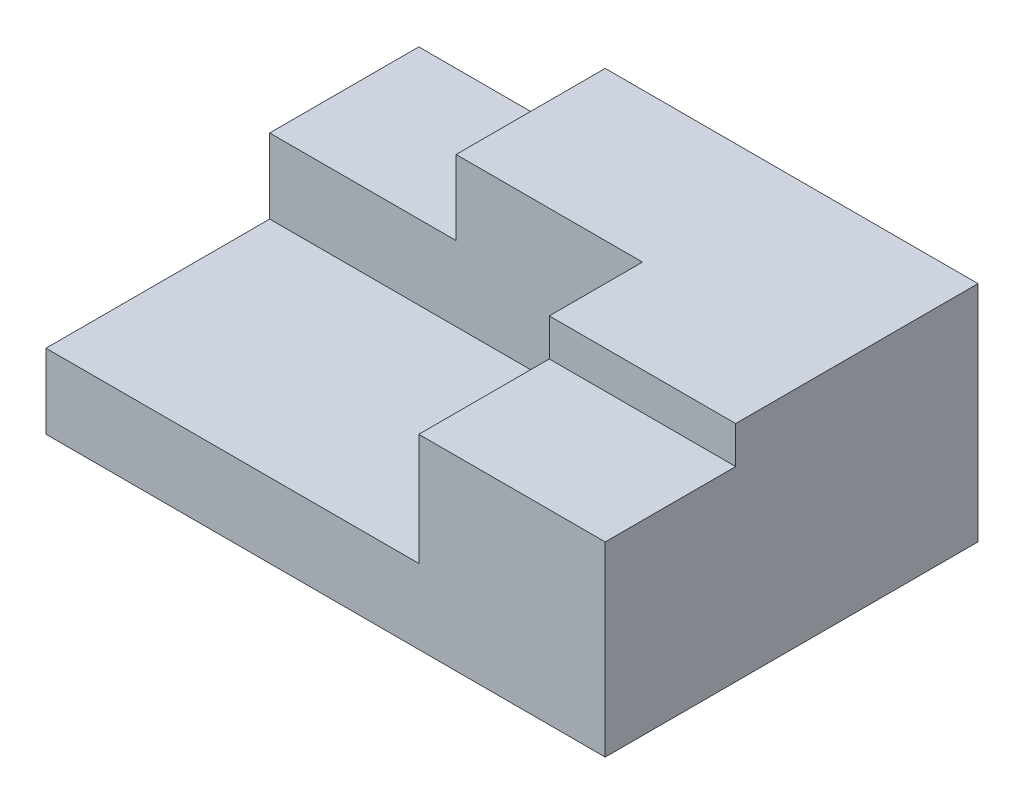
from build123d import *

# Parameters (mm, degrees)
SKIZZE1_W                       = 150
SKIZZE1_H                       = 100
AUFSATZ_LINEAR_AUSTRAGEN1_DEPTH = 60
SKIZZE2_W                       = 100
SKIZZE2_H                       = 60
SCHNITT_LINEAR_AUSTRAGEN1_DEPTH = 40
SKIZZE4_W                       = 50
SKIZZE4_H                       = 40
SCHNITT_LINEAR_AUSTRAGEN3_DEPTH = 20
SKIZZE5_W                       = 50
SKIZZE5_H                       = 35
SCHNITT_LINEAR_AUSTRAGEN4_DEPTH = 10


with BuildPart() as part:
    # Skizze1 → Aufsatz-Linear austragen1 (new body)
    with BuildSketch(Plane(origin=(0, 0, 0), x_dir=(1, 0, 0), z_dir=(0, 1, 0))):
        with Locations((75, 50)):
            Rectangle(SKIZZE1_W, SKIZZE1_H)
    extrude(amount=AUFSATZ_LINEAR_AUSTRAGEN1_DEPTH)

    # Skizze2 → Schnitt-Linear austragen1 (cut)
    with BuildSketch(Plane(origin=(0, 60, 0), x_dir=(1, 0, 0), z_dir=(0, 1, 0))):
        with Locations((50, 30)):
            Rectangle(SKIZZE2_W, SKIZZE2_H)
    extrude(amount=-SCHNITT_LINEAR_AUSTRAGEN1_DEPTH, mode=Mode.SUBTRACT)

    # Skizze4 → Schnitt-Linear austragen3 (cut)
    with BuildSketch(Plane(origin=(0, 60, 0), x_dir=(1, 0, 0), z_dir=(0, 1, 0))):
        with Locations((25, 80)):
            Rectangle(SKIZZE4_W, SKIZZE4_H)
    extrude(amount=-SCHNITT_LINEAR_AUSTRAGEN3_DEPTH, mode=Mode.SUBTRACT)

    # Skizze5 → Schnitt-Linear austragen4 (cut)
    with BuildSketch(Plane(origin=(0, 60, 0), x_dir=(1, 0, 0), z_dir=(0, 1, 0))):
        with Locations((125, 17.5)):
            Rectangle(SKIZZE5_W, SKIZZE5_H)
    extrude(amount=-SCHNITT_LINEAR_AUSTRAGEN4_DEPTH, mode=Mode.SUBTRACT)


solid = part.part
